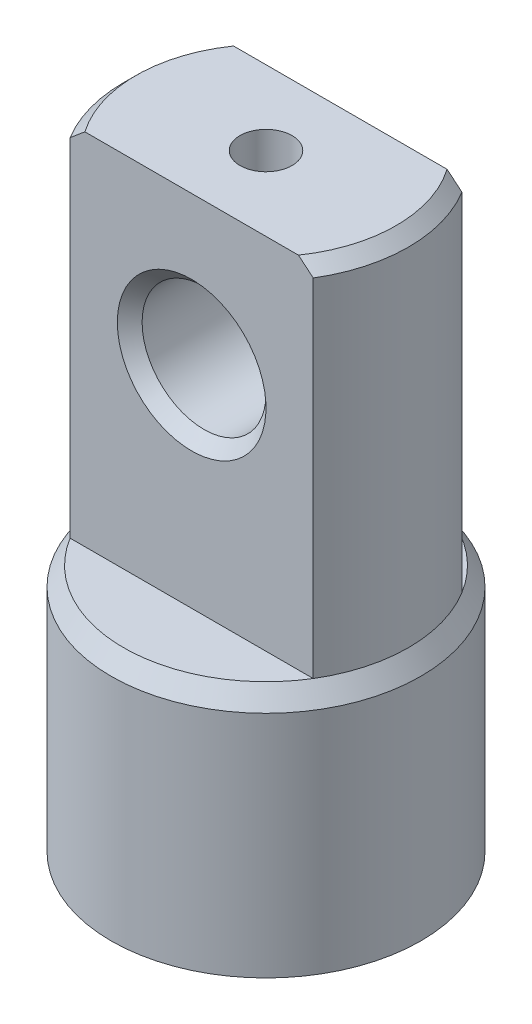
ISO-10303-21;
HEADER;
FILE_DESCRIPTION(('STEP AP214'),'2;1');
FILE_NAME('part.step','',(''),(''),'','','');
FILE_SCHEMA(('AUTOMOTIVE_DESIGN { 1 0 10303 214 1 1 1 1 }'));
ENDSEC;
DATA;
#1=APPLICATION_CONTEXT('core data for automotive mechanical design processes');
#2=APPLICATION_PROTOCOL_DEFINITION('international standard','automotive_design',2000,#1);
#3=PRODUCT_CONTEXT('',#1,'mechanical');
#4=PRODUCT('Part','Part','',(#3));
#5=PRODUCT_RELATED_PRODUCT_CATEGORY('part','',(#4));
#6=PRODUCT_DEFINITION_FORMATION('','',#4);
#7=PRODUCT_DEFINITION_CONTEXT('part definition',#1,'design');
#8=PRODUCT_DEFINITION('design','',#6,#7);
#9=PRODUCT_DEFINITION_SHAPE('','',#8);
#10=(LENGTH_UNIT() NAMED_UNIT(*) SI_UNIT(.MILLI.,.METRE.));
#11=(NAMED_UNIT(*) PLANE_ANGLE_UNIT() SI_UNIT($,.RADIAN.));
#12=(NAMED_UNIT(*) SI_UNIT($,.STERADIAN.) SOLID_ANGLE_UNIT());
#13=UNCERTAINTY_MEASURE_WITH_UNIT(LENGTH_MEASURE(1.E-05),#10,'distance_accuracy_value','');
#14=(GEOMETRIC_REPRESENTATION_CONTEXT(3) GLOBAL_UNCERTAINTY_ASSIGNED_CONTEXT((#13)) GLOBAL_UNIT_ASSIGNED_CONTEXT((#10,
#11,#12)) REPRESENTATION_CONTEXT('',''));
#15=CARTESIAN_POINT('',(0.,0.,0.));
#16=DIRECTION('',(0.,0.,1.));
#17=DIRECTION('',(1.,0.,0.));
#18=AXIS2_PLACEMENT_3D('',#15,#16,#17);
#19=CARTESIAN_POINT('',(0.,0.,0.));
#20=DIRECTION('',(0.,-1.,0.));
#21=DIRECTION('',(0.,0.,-1.));
#22=AXIS2_PLACEMENT_3D('',#19,#20,#21);
#23=CYLINDRICAL_SURFACE('',#22,11.5);
#24=DIRECTION('',(0.,-1.,0.));
#25=VECTOR('',#24,1.);
#26=CARTESIAN_POINT('',(9.81070843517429,0.,-6.));
#27=LINE('',#26,#25);
#28=CARTESIAN_POINT('',(9.81070843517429,48.,-6.));
#29=VERTEX_POINT('',#28);
#30=CARTESIAN_POINT('',(9.81070843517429,20.,-6.));
#31=VERTEX_POINT('',#30);
#32=EDGE_CURVE('E127',#29,#31,#27,.T.);
#33=ORIENTED_EDGE('',*,*,#32,.F.);
#34=CARTESIAN_POINT('',(0.,48.,0.));
#35=DIRECTION('',(0.,1.,0.));
#36=DIRECTION('',(0.,0.,1.));
#37=AXIS2_PLACEMENT_3D('',#34,#35,#36);
#38=CIRCLE('',#37,11.5);
#39=CARTESIAN_POINT('',(9.81070843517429,48.,6.));
#40=VERTEX_POINT('',#39);
#41=EDGE_CURVE('E113',#29,#40,#38,.F.);
#42=ORIENTED_EDGE('',*,*,#41,.T.);
#43=DIRECTION('',(0.,-1.,0.));
#44=VECTOR('',#43,1.);
#45=CARTESIAN_POINT('',(9.81070843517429,0.,6.));
#46=LINE('',#45,#44);
#47=CARTESIAN_POINT('',(9.81070843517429,20.,6.));
#48=VERTEX_POINT('',#47);
#49=EDGE_CURVE('E103',#48,#40,#46,.F.);
#50=ORIENTED_EDGE('',*,*,#49,.F.);
#51=CARTESIAN_POINT('',(0.,20.,0.));
#52=DIRECTION('',(0.,-1.,0.));
#53=DIRECTION('',(0.,0.,-1.));
#54=AXIS2_PLACEMENT_3D('',#51,#52,#53);
#55=CIRCLE('',#54,11.5);
#56=EDGE_CURVE('E95',#31,#48,#55,.T.);
#57=ORIENTED_EDGE('',*,*,#56,.F.);
#58=EDGE_LOOP('',(#33,#42,#50,#57));
#59=FACE_BOUND('',#58,.T.);
#60=ADVANCED_FACE('F32',(#59),#23,.T.);
#61=CARTESIAN_POINT('',(0.,0.,0.));
#62=DIRECTION('',(0.,-1.,0.));
#63=DIRECTION('',(0.,0.,-1.));
#64=AXIS2_PLACEMENT_3D('',#61,#62,#63);
#65=PLANE('',#64);
#66=CARTESIAN_POINT('',(0.,0.,0.));
#67=DIRECTION('',(0.,-1.,0.));
#68=DIRECTION('',(0.,0.,-1.));
#69=AXIS2_PLACEMENT_3D('',#66,#67,#68);
#70=CIRCLE('',#69,12.5);
#71=CARTESIAN_POINT('',(0.,0.,-12.5));
#72=VERTEX_POINT('',#71);
#73=EDGE_CURVE('E122',#72,#72,#70,.T.);
#74=ORIENTED_EDGE('',*,*,#73,.T.);
#75=EDGE_LOOP('',(#74));
#76=FACE_BOUND('',#75,.T.);
#77=ADVANCED_FACE('F157',(#76),#65,.T.);
#78=CARTESIAN_POINT('',(0.,0.,0.));
#79=DIRECTION('',(0.,-1.,0.));
#80=DIRECTION('',(0.,0.,-1.));
#81=AXIS2_PLACEMENT_3D('',#78,#79,#80);
#82=CYLINDRICAL_SURFACE('',#81,12.5);
#83=CARTESIAN_POINT('',(0.,18.5,0.));
#84=DIRECTION('',(0.,-1.,0.));
#85=DIRECTION('',(0.,0.,-1.));
#86=AXIS2_PLACEMENT_3D('',#83,#84,#85);
#87=CIRCLE('',#86,12.5);
#88=CARTESIAN_POINT('',(0.,18.5,-12.5));
#89=VERTEX_POINT('',#88);
#90=EDGE_CURVE('E120',#89,#89,#87,.T.);
#91=ORIENTED_EDGE('',*,*,#90,.T.);
#92=EDGE_LOOP('',(#91));
#93=FACE_BOUND('',#92,.T.);
#94=ORIENTED_EDGE('',*,*,#73,.F.);
#95=EDGE_LOOP('',(#94));
#96=FACE_BOUND('',#95,.T.);
#97=ADVANCED_FACE('F163',(#93,#96),#82,.T.);
#98=CARTESIAN_POINT('',(0.,18.5,0.));
#99=DIRECTION('',(0.,-1.,0.));
#100=DIRECTION('',(0.,0.,-1.));
#101=AXIS2_PLACEMENT_3D('',#98,#99,#100);
#102=CONICAL_SURFACE('',#101,12.5,0.58800260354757);
#103=ORIENTED_EDGE('',*,*,#56,.T.);
#104=CARTESIAN_POINT('',(-9.81070843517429,20.,6.));
#105=VERTEX_POINT('',#104);
#106=EDGE_CURVE('E88',#48,#105,#55,.T.);
#107=ORIENTED_EDGE('',*,*,#106,.T.);
#108=CARTESIAN_POINT('',(-9.81070843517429,20.,-6.));
#109=VERTEX_POINT('',#108);
#110=EDGE_CURVE('E96',#105,#109,#55,.T.);
#111=ORIENTED_EDGE('',*,*,#110,.T.);
#112=EDGE_CURVE('E98',#109,#31,#55,.T.);
#113=ORIENTED_EDGE('',*,*,#112,.T.);
#114=EDGE_LOOP('',(#103,#107,#111,#113));
#115=FACE_BOUND('',#114,.T.);
#116=ORIENTED_EDGE('',*,*,#90,.F.);
#117=EDGE_LOOP('',(#116));
#118=FACE_BOUND('',#117,.T.);
#119=ADVANCED_FACE('F117',(#115,#118),#102,.T.);
#120=DIRECTION('',(0.,-1.,0.));
#121=VECTOR('',#120,1.);
#122=CARTESIAN_POINT('',(-9.81070843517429,0.,6.));
#123=LINE('',#122,#121);
#124=CARTESIAN_POINT('',(-9.81070843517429,48.,6.));
#125=VERTEX_POINT('',#124);
#126=EDGE_CURVE('E105',#125,#105,#123,.T.);
#127=ORIENTED_EDGE('',*,*,#126,.F.);
#128=CARTESIAN_POINT('',(0.,48.,0.));
#129=DIRECTION('',(0.,1.,0.));
#130=DIRECTION('',(0.,0.,1.));
#131=AXIS2_PLACEMENT_3D('',#128,#129,#130);
#132=CIRCLE('',#131,11.5);
#133=CARTESIAN_POINT('',(-9.81070843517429,48.,-6.));
#134=VERTEX_POINT('',#133);
#135=EDGE_CURVE('E177',#125,#134,#132,.F.);
#136=ORIENTED_EDGE('',*,*,#135,.T.);
#137=DIRECTION('',(0.,-1.,0.));
#138=VECTOR('',#137,1.);
#139=CARTESIAN_POINT('',(-9.81070843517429,0.,-6.));
#140=LINE('',#139,#138);
#141=EDGE_CURVE('E125',#109,#134,#140,.F.);
#142=ORIENTED_EDGE('',*,*,#141,.F.);
#143=ORIENTED_EDGE('',*,*,#110,.F.);
#144=EDGE_LOOP('',(#127,#136,#142,#143));
#145=FACE_BOUND('',#144,.T.);
#146=ADVANCED_FACE('F159',(#145),#23,.T.);
#147=CARTESIAN_POINT('',(11.5,49.,0.));
#148=DIRECTION('',(0.,1.,0.));
#149=DIRECTION('',(0.,0.,1.));
#150=AXIS2_PLACEMENT_3D('',#147,#148,#149);
#151=PLANE('',#150);
#152=CARTESIAN_POINT('',(0.,49.,0.));
#153=DIRECTION('',(0.,1.,0.));
#154=DIRECTION('',(0.,0.,1.));
#155=AXIS2_PLACEMENT_3D('',#152,#153,#154);
#156=CIRCLE('',#155,2.1);
#157=CARTESIAN_POINT('',(0.,49.,2.1));
#158=VERTEX_POINT('',#157);
#159=EDGE_CURVE('E142',#158,#158,#156,.T.);
#160=ORIENTED_EDGE('',*,*,#159,.F.);
#161=EDGE_LOOP('',(#160));
#162=FACE_BOUND('',#161,.T.);
#163=DIRECTION('',(-1.,0.,0.));
#164=VECTOR('',#163,1.);
#165=CARTESIAN_POINT('',(11.5,49.,6.));
#166=LINE('',#165,#164);
#167=CARTESIAN_POINT('',(8.61684396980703,49.,6.));
#168=VERTEX_POINT('',#167);
#169=CARTESIAN_POINT('',(-8.61684396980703,49.,6.));
#170=VERTEX_POINT('',#169);
#171=EDGE_CURVE('E210',#168,#170,#166,.T.);
#172=ORIENTED_EDGE('',*,*,#171,.F.);
#173=CARTESIAN_POINT('',(0.,49.,0.));
#174=DIRECTION('',(0.,1.,0.));
#175=DIRECTION('',(0.,0.,1.));
#176=AXIS2_PLACEMENT_3D('',#173,#174,#175);
#177=CIRCLE('',#176,10.5);
#178=CARTESIAN_POINT('',(8.61684396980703,49.,-6.));
#179=VERTEX_POINT('',#178);
#180=EDGE_CURVE('E55',#168,#179,#177,.T.);
#181=ORIENTED_EDGE('',*,*,#180,.T.);
#182=DIRECTION('',(1.,0.,0.));
#183=VECTOR('',#182,1.);
#184=CARTESIAN_POINT('',(11.5,49.,-6.));
#185=LINE('',#184,#183);
#186=CARTESIAN_POINT('',(-8.61684396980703,49.,-6.));
#187=VERTEX_POINT('',#186);
#188=EDGE_CURVE('E208',#187,#179,#185,.T.);
#189=ORIENTED_EDGE('',*,*,#188,.F.);
#190=CARTESIAN_POINT('',(0.,49.,0.));
#191=DIRECTION('',(0.,1.,0.));
#192=DIRECTION('',(0.,0.,1.));
#193=AXIS2_PLACEMENT_3D('',#190,#191,#192);
#194=CIRCLE('',#193,10.5);
#195=EDGE_CURVE('E244',#187,#170,#194,.T.);
#196=ORIENTED_EDGE('',*,*,#195,.T.);
#197=EDGE_LOOP('',(#172,#181,#189,#196));
#198=FACE_BOUND('',#197,.T.);
#199=ADVANCED_FACE('F169',(#162,#198),#151,.T.);
#200=CARTESIAN_POINT('',(-10.9658560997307,20.,-6.));
#201=DIRECTION('',(0.,0.,1.));
#202=DIRECTION('',(1.,0.,0.));
#203=AXIS2_PLACEMENT_3D('',#200,#201,#202);
#204=PLANE('',#203);
#205=CARTESIAN_POINT('',(0.,37.,-6.));
#206=DIRECTION('',(0.,0.,1.));
#207=DIRECTION('',(1.,0.,0.));
#208=AXIS2_PLACEMENT_3D('',#205,#206,#207);
#209=CIRCLE('',#208,5.99999999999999);
#210=CARTESIAN_POINT('',(5.99999999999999,37.,-6.));
#211=VERTEX_POINT('',#210);
#212=EDGE_CURVE('E181',#211,#211,#209,.T.);
#213=ORIENTED_EDGE('',*,*,#212,.T.);
#214=EDGE_LOOP('',(#213));
#215=FACE_BOUND('',#214,.T.);
#216=ORIENTED_EDGE('',*,*,#188,.T.);
#217=CARTESIAN_POINT('',(8.61684396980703,49.,-6.));
#218=CARTESIAN_POINT('',(8.71716770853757,48.9176678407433,-6.));
#219=CARTESIAN_POINT('',(8.81726226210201,48.8350568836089,-6.));
#220=CARTESIAN_POINT('',(9.01702237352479,48.6693224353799,-6.));
#221=CARTESIAN_POINT('',(9.11668794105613,48.5861989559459,-6.));
#222=CARTESIAN_POINT('',(9.31562370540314,48.4194810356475,-6.));
#223=CARTESIAN_POINT('',(9.41489390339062,48.3358865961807,-6.));
#224=CARTESIAN_POINT('',(9.61306891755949,48.1682611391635,-6.));
#225=CARTESIAN_POINT('',(9.7119737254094,48.0842301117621,-6.));
#226=CARTESIAN_POINT('',(9.81070843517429,48.,-6.));
#227=B_SPLINE_CURVE_WITH_KNOTS('',3,(#217,#218,#219,#220,#221,#222,#223,#224,#225,#226),
.UNSPECIFIED.,.F.,.F.,(4,2,2,2,4),(0.,0.389345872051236,0.778682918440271,1.16801881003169,
1.55736352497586),.UNSPECIFIED.);
#228=EDGE_CURVE('E182',#179,#29,#227,.T.);
#229=ORIENTED_EDGE('',*,*,#228,.T.);
#230=ORIENTED_EDGE('',*,*,#32,.T.);
#231=DIRECTION('',(1.,0.,0.));
#232=VECTOR('',#231,1.);
#233=CARTESIAN_POINT('',(-10.9658560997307,20.,-6.));
#234=LINE('',#233,#232);
#235=EDGE_CURVE('E114',#109,#31,#234,.T.);
#236=ORIENTED_EDGE('',*,*,#235,.F.);
#237=ORIENTED_EDGE('',*,*,#141,.T.);
#238=CARTESIAN_POINT('',(-9.81070843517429,48.,-6.));
#239=CARTESIAN_POINT('',(-9.7119737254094,48.0842301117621,-6.));
#240=CARTESIAN_POINT('',(-9.61306891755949,48.1682611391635,-6.));
#241=CARTESIAN_POINT('',(-9.41489390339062,48.3358865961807,-6.));
#242=CARTESIAN_POINT('',(-9.31562370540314,48.4194810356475,-6.));
#243=CARTESIAN_POINT('',(-9.11668794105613,48.5861989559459,-6.));
#244=CARTESIAN_POINT('',(-9.01702237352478,48.6693224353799,-6.));
#245=CARTESIAN_POINT('',(-8.81726226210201,48.8350568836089,-6.));
#246=CARTESIAN_POINT('',(-8.71716770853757,48.9176678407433,-6.));
#247=CARTESIAN_POINT('',(-8.61684396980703,49.,-6.));
#248=B_SPLINE_CURVE_WITH_KNOTS('',3,(#238,#239,#240,#241,#242,#243,#244,#245,#246,#247),
.UNSPECIFIED.,.F.,.F.,(4,2,2,2,4),(0.,0.389344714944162,0.778680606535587,1.16801765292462,
1.55736352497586),.UNSPECIFIED.);
#249=EDGE_CURVE('E47',#134,#187,#248,.T.);
#250=ORIENTED_EDGE('',*,*,#249,.T.);
#251=EDGE_LOOP('',(#216,#229,#230,#236,#237,#250));
#252=FACE_BOUND('',#251,.T.);
#253=ADVANCED_FACE('F175',(#215,#252),#204,.F.);
#254=CARTESIAN_POINT('',(0.,20.,0.));
#255=DIRECTION('',(0.,1.,0.));
#256=DIRECTION('',(0.,0.,1.));
#257=AXIS2_PLACEMENT_3D('',#254,#255,#256);
#258=PLANE('',#257);
#259=ORIENTED_EDGE('',*,*,#235,.T.);
#260=ORIENTED_EDGE('',*,*,#112,.F.);
#261=EDGE_LOOP('',(#259,#260));
#262=FACE_BOUND('',#261,.T.);
#263=ADVANCED_FACE('F207',(#262),#258,.T.);
#264=CARTESIAN_POINT('',(-10.9658560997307,20.,6.));
#265=DIRECTION('',(0.,0.,-1.));
#266=DIRECTION('',(-1.,0.,0.));
#267=AXIS2_PLACEMENT_3D('',#264,#265,#266);
#268=PLANE('',#267);
#269=CARTESIAN_POINT('',(0.,37.,6.));
#270=DIRECTION('',(0.,0.,-1.));
#271=DIRECTION('',(-1.,0.,0.));
#272=AXIS2_PLACEMENT_3D('',#269,#270,#271);
#273=CIRCLE('',#272,6.00000000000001);
#274=CARTESIAN_POINT('',(-6.00000000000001,37.,6.));
#275=VERTEX_POINT('',#274);
#276=EDGE_CURVE('E11',#275,#275,#273,.T.);
#277=ORIENTED_EDGE('',*,*,#276,.T.);
#278=EDGE_LOOP('',(#277));
#279=FACE_BOUND('',#278,.T.);
#280=ORIENTED_EDGE('',*,*,#49,.T.);
#281=CARTESIAN_POINT('',(9.81070843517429,48.,6.));
#282=CARTESIAN_POINT('',(9.7119737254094,48.0842301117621,6.));
#283=CARTESIAN_POINT('',(9.61306891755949,48.1682611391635,6.));
#284=CARTESIAN_POINT('',(9.41489390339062,48.3358865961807,6.));
#285=CARTESIAN_POINT('',(9.31562370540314,48.4194810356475,6.));
#286=CARTESIAN_POINT('',(9.11668794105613,48.5861989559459,6.));
#287=CARTESIAN_POINT('',(9.01702237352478,48.6693224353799,6.));
#288=CARTESIAN_POINT('',(8.81726226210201,48.8350568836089,6.));
#289=CARTESIAN_POINT('',(8.71716770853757,48.9176678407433,6.));
#290=CARTESIAN_POINT('',(8.61684396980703,49.,6.));
#291=B_SPLINE_CURVE_WITH_KNOTS('',3,(#281,#282,#283,#284,#285,#286,#287,#288,#289,#290),
.UNSPECIFIED.,.F.,.F.,(4,2,2,2,4),(0.,0.389344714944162,0.778680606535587,1.16801765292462,
1.55736352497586),.UNSPECIFIED.);
#292=EDGE_CURVE('E214',#40,#168,#291,.T.);
#293=ORIENTED_EDGE('',*,*,#292,.T.);
#294=ORIENTED_EDGE('',*,*,#171,.T.);
#295=CARTESIAN_POINT('',(-8.61684396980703,49.,6.));
#296=CARTESIAN_POINT('',(-8.71716770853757,48.9176678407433,6.));
#297=CARTESIAN_POINT('',(-8.81726226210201,48.8350568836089,6.));
#298=CARTESIAN_POINT('',(-9.01702237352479,48.6693224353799,6.));
#299=CARTESIAN_POINT('',(-9.11668794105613,48.5861989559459,6.));
#300=CARTESIAN_POINT('',(-9.31562370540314,48.4194810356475,6.));
#301=CARTESIAN_POINT('',(-9.41489390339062,48.3358865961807,6.));
#302=CARTESIAN_POINT('',(-9.61306891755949,48.1682611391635,6.));
#303=CARTESIAN_POINT('',(-9.7119737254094,48.0842301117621,6.));
#304=CARTESIAN_POINT('',(-9.81070843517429,48.,6.));
#305=B_SPLINE_CURVE_WITH_KNOTS('',3,(#295,#296,#297,#298,#299,#300,#301,#302,#303,#304),
.UNSPECIFIED.,.F.,.F.,(4,2,2,2,4),(0.,0.389345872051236,0.778682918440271,1.16801881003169,
1.55736352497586),.UNSPECIFIED.);
#306=EDGE_CURVE('E180',#170,#125,#305,.T.);
#307=ORIENTED_EDGE('',*,*,#306,.T.);
#308=ORIENTED_EDGE('',*,*,#126,.T.);
#309=DIRECTION('',(-1.,0.,0.));
#310=VECTOR('',#309,1.);
#311=CARTESIAN_POINT('',(-10.9658560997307,20.,6.));
#312=LINE('',#311,#310);
#313=EDGE_CURVE('E91',#48,#105,#312,.T.);
#314=ORIENTED_EDGE('',*,*,#313,.F.);
#315=EDGE_LOOP('',(#280,#293,#294,#307,#308,#314));
#316=FACE_BOUND('',#315,.T.);
#317=ADVANCED_FACE('F102',(#279,#316),#268,.F.);
#318=CARTESIAN_POINT('',(0.,20.,0.));
#319=DIRECTION('',(0.,1.,0.));
#320=DIRECTION('',(0.,0.,1.));
#321=AXIS2_PLACEMENT_3D('',#318,#319,#320);
#322=PLANE('',#321);
#323=ORIENTED_EDGE('',*,*,#313,.T.);
#324=ORIENTED_EDGE('',*,*,#106,.F.);
#325=EDGE_LOOP('',(#323,#324));
#326=FACE_BOUND('',#325,.T.);
#327=ADVANCED_FACE('F90',(#326),#322,.T.);
#328=CARTESIAN_POINT('',(0.,48.,0.));
#329=DIRECTION('',(0.,-1.,0.));
#330=DIRECTION('',(0.,0.,-1.));
#331=AXIS2_PLACEMENT_3D('',#328,#329,#330);
#332=CONICAL_SURFACE('',#331,11.5,0.78539816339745);
#333=ORIENTED_EDGE('',*,*,#228,.F.);
#334=ORIENTED_EDGE('',*,*,#180,.F.);
#335=ORIENTED_EDGE('',*,*,#292,.F.);
#336=ORIENTED_EDGE('',*,*,#41,.F.);
#337=EDGE_LOOP('',(#333,#334,#335,#336));
#338=FACE_BOUND('',#337,.T.);
#339=ADVANCED_FACE('F213',(#338),#332,.T.);
#340=CARTESIAN_POINT('',(0.,48.,0.));
#341=DIRECTION('',(0.,-1.,0.));
#342=DIRECTION('',(0.,0.,-1.));
#343=AXIS2_PLACEMENT_3D('',#340,#341,#342);
#344=CONICAL_SURFACE('',#343,11.5,0.78539816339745);
#345=ORIENTED_EDGE('',*,*,#306,.F.);
#346=ORIENTED_EDGE('',*,*,#195,.F.);
#347=ORIENTED_EDGE('',*,*,#249,.F.);
#348=ORIENTED_EDGE('',*,*,#135,.F.);
#349=EDGE_LOOP('',(#345,#346,#347,#348));
#350=FACE_BOUND('',#349,.T.);
#351=ADVANCED_FACE('F179',(#350),#344,.T.);
#352=CARTESIAN_POINT('',(0.,37.,6.));
#353=DIRECTION('',(0.,0.,1.));
#354=DIRECTION('',(1.,0.,0.));
#355=AXIS2_PLACEMENT_3D('',#352,#353,#354);
#356=CYLINDRICAL_SURFACE('',#355,5.);
#357=CARTESIAN_POINT('',(0.,42.,2.1));
#358=CARTESIAN_POINT('',(0.112421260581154,41.9999933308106,2.0999912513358));
#359=CARTESIAN_POINT('',(0.225000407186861,41.9961659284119,2.09092141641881));
#360=CARTESIAN_POINT('',(0.446972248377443,41.981231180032,2.05497450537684));
#361=CARTESIAN_POINT('',(0.55635593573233,41.9701050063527,2.02805137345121));
#362=CARTESIAN_POINT('',(0.76835039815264,41.9417643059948,1.95756693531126));
#363=CARTESIAN_POINT('',(0.87098288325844,41.9245705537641,1.91406236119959));
#364=CARTESIAN_POINT('',(1.06739278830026,41.8857658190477,1.81188714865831));
#365=CARTESIAN_POINT('',(1.16117280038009,41.8641561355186,1.75322096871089));
#366=CARTESIAN_POINT('',(1.3421338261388,41.817448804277,1.61923837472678));
#367=CARTESIAN_POINT('',(1.42880573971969,41.7922357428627,1.54327496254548));
#368=CARTESIAN_POINT('',(1.58861874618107,41.741659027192,1.37822285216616));
#369=CARTESIAN_POINT('',(1.66175260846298,41.7162952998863,1.2891271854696));
#370=CARTESIAN_POINT('',(1.79604183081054,41.6668635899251,1.09492195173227));
#371=CARTESIAN_POINT('',(1.85641196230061,41.6429244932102,0.989233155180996));
#372=CARTESIAN_POINT('',(1.9582903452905,41.6008867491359,0.768050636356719));
#373=CARTESIAN_POINT('',(1.99980846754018,41.5827850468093,0.652562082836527));
#374=CARTESIAN_POINT('',(2.06069339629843,41.5557228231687,0.420918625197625));
#375=CARTESIAN_POINT('',(2.08104088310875,41.5463599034,0.305070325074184));
#376=CARTESIAN_POINT('',(2.10206556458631,41.5366803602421,0.0712546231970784));
#377=CARTESIAN_POINT('',(2.10275385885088,41.5363586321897,-0.0467115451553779));
#378=CARTESIAN_POINT('',(2.08517838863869,41.5444578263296,-0.271572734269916));
#379=CARTESIAN_POINT('',(2.06839112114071,41.5521976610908,-0.378612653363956));
#380=CARTESIAN_POINT('',(2.01882069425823,41.5743953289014,-0.588185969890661));
#381=CARTESIAN_POINT('',(1.98603441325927,41.5888544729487,-0.690718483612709));
#382=CARTESIAN_POINT('',(1.9047552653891,41.6231896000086,-0.890977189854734));
#383=CARTESIAN_POINT('',(1.8559407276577,41.6431750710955,-0.988553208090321));
#384=CARTESIAN_POINT('',(1.74421855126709,41.6862864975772,-1.17451248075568));
#385=CARTESIAN_POINT('',(1.68130530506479,41.7094137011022,-1.26289205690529));
#386=CARTESIAN_POINT('',(1.53682141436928,41.7586218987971,-1.43594957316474));
#387=CARTESIAN_POINT('',(1.4541115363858,41.784785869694,-1.51965550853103));
#388=CARTESIAN_POINT('',(1.27557303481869,41.8354439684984,-1.67233793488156));
#389=CARTESIAN_POINT('',(1.17974124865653,41.8599376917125,-1.74131086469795));
#390=CARTESIAN_POINT('',(0.974684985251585,41.9052275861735,-1.86402615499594));
#391=CARTESIAN_POINT('',(0.865196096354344,41.9259219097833,-1.9173670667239));
#392=CARTESIAN_POINT('',(0.637707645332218,41.9604970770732,-2.00453047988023));
#393=CARTESIAN_POINT('',(0.519712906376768,41.974381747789,-2.03836394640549));
#394=CARTESIAN_POINT('',(0.286679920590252,41.993054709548,-2.08350356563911));
#395=CARTESIAN_POINT('',(0.171936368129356,41.9983686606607,-2.09611378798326));
#396=CARTESIAN_POINT('',(-0.0581412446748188,42.0009838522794,-2.10234434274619));
#397=CARTESIAN_POINT('',(-0.173475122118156,41.998287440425,-2.0959702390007));
#398=CARTESIAN_POINT('',(-0.395312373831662,41.9855250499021,-2.06534125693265));
#399=CARTESIAN_POINT('',(-0.501967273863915,41.9758388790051,-2.04200747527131));
#400=CARTESIAN_POINT('',(-0.709728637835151,41.9504793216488,-1.97940931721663));
#401=CARTESIAN_POINT('',(-0.810834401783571,41.934805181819,-1.94014293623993));
#402=CARTESIAN_POINT('',(-1.00818189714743,41.8983626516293,-1.84551304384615));
#403=CARTESIAN_POINT('',(-1.10417428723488,41.877450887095,-1.78968654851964));
#404=CARTESIAN_POINT('',(-1.2857730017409,41.8327577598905,-1.66402912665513));
#405=CARTESIAN_POINT('',(-1.37137493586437,41.808975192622,-1.59419231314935));
#406=CARTESIAN_POINT('',(-1.53629380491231,41.758966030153,-1.43657093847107));
#407=CARTESIAN_POINT('',(-1.61470399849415,41.7326873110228,-1.34785177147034));
#408=CARTESIAN_POINT('',(-1.75578239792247,41.682185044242,-1.15810542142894));
#409=CARTESIAN_POINT('',(-1.81844681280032,41.6579619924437,-1.05707528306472));
#410=CARTESIAN_POINT('',(-1.92699302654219,41.6141295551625,-0.843367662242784));
#411=CARTESIAN_POINT('',(-1.97260446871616,41.5945961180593,-0.730536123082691));
#412=CARTESIAN_POINT('',(-2.04378702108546,41.563383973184,-0.497714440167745));
#413=CARTESIAN_POINT('',(-2.06937501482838,41.5516986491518,-0.37773041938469));
#414=CARTESIAN_POINT('',(-2.09809375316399,41.5385272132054,-0.144087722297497));
#415=CARTESIAN_POINT('',(-2.10281966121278,41.5363170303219,-0.0306650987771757));
#416=CARTESIAN_POINT('',(-2.09395263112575,41.5404170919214,0.195292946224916));
#417=CARTESIAN_POINT('',(-2.0803626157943,41.5467259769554,0.307828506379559));
#418=CARTESIAN_POINT('',(-2.03659654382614,41.5664869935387,0.523240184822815));
#419=CARTESIAN_POINT('',(-2.00724892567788,41.5795812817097,0.626320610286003));
#420=CARTESIAN_POINT('',(-1.93361811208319,41.6111513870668,0.826114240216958));
#421=CARTESIAN_POINT('',(-1.88933070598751,41.6296287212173,0.922825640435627));
#422=CARTESIAN_POINT('',(-1.78398506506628,41.6712723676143,1.11354185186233));
#423=CARTESIAN_POINT('',(-1.72207244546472,41.6946551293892,1.2070265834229));
#424=CARTESIAN_POINT('',(-1.5844223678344,41.7428812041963,1.38277882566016));
#425=CARTESIAN_POINT('',(-1.50867999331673,41.7677250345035,1.46504232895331));
#426=CARTESIAN_POINT('',(-1.33881414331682,41.8182968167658,1.62232622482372));
#427=CARTESIAN_POINT('',(-1.24374163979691,41.8439527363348,1.69635035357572));
#428=CARTESIAN_POINT('',(-1.04160910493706,41.8914040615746,1.82745043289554));
#429=CARTESIAN_POINT('',(-0.934543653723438,41.9131977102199,1.88451867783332));
#430=CARTESIAN_POINT('',(-0.712909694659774,41.9501639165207,1.97888688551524));
#431=CARTESIAN_POINT('',(-0.598488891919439,41.965436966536,2.01648893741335));
#432=CARTESIAN_POINT('',(-0.423046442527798,41.9824202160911,2.0578272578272));
#433=CARTESIAN_POINT('',(-0.363983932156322,41.9870920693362,2.06909260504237));
#434=CARTESIAN_POINT('',(-0.244993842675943,41.9943480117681,2.08652360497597));
#435=CARTESIAN_POINT('',(-0.185066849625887,41.9969334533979,2.09269256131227));
#436=CARTESIAN_POINT('',(-0.0833788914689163,41.9994792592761,2.0987597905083));
#437=CARTESIAN_POINT('',(-0.0417003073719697,42.0000024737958,2.10000324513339));
#438=CARTESIAN_POINT('',(0.,42.,2.1));
#439=B_SPLINE_CURVE_WITH_KNOTS('',3,(#357,#358,#359,#360,#361,#362,#363,#364,#365,#366,#367,
#368,#369,#370,#371,#372,#373,#374,#375,#376,#377,#378,#379,#380,#381,#382,#383,#384,#385,#386,
#387,#388,#389,#390,#391,#392,#393,#394,#395,#396,#397,#398,#399,#400,#401,#402,#403,#404,#405,
#406,#407,#408,#409,#410,#411,#412,#413,#414,#415,#416,#417,#418,#419,#420,#421,#422,#423,#424,
#425,#426,#427,#428,#429,#430,#431,#432,#433,#434,#435,#436,#437,#438),.UNSPECIFIED.,.T.,.F.,(4,
2,2,2,2,2,2,2,2,2,2,2,2,2,2,2,2,2,2,2,2,2,2,2,2,2,2,2,2,2,2,2,2,2,2,2,2,2,2,2,4),(0.,
0.337117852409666,0.675108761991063,1.01195349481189,1.34869928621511,1.70109212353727,
2.05367263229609,2.42394551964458,2.79402431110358,3.14607251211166,3.49792194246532,
3.82228185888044,4.14670508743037,4.47808378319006,4.809594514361,5.16961532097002,
5.52972305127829,5.89839924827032,6.26686801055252,6.61173647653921,6.95650388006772,
7.28382587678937,7.61118906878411,7.94874145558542,8.28643597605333,8.64863382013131,
9.01091878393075,9.37872565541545,9.74622206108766,10.0850701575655,10.4238641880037,
10.7463772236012,11.0689812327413,11.4111551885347,11.7534510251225,12.1212491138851,
12.4892140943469,12.851283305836,13.0320009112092,13.2126012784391,13.3376480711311),.UNSPECIFIED.);
#440=CARTESIAN_POINT('',(0.,42.,2.1));
#441=VERTEX_POINT('',#440);
#442=EDGE_CURVE('E106',#441,#441,#439,.T.);
#443=ORIENTED_EDGE('',*,*,#442,.T.);
#444=EDGE_LOOP('',(#443));
#445=FACE_BOUND('',#444,.T.);
#446=CARTESIAN_POINT('',(0.,37.,-5.));
#447=DIRECTION('',(0.,0.,1.));
#448=DIRECTION('',(1.,0.,0.));
#449=AXIS2_PLACEMENT_3D('',#446,#447,#448);
#450=CIRCLE('',#449,5.);
#451=CARTESIAN_POINT('',(5.,37.,-5.));
#452=VERTEX_POINT('',#451);
#453=EDGE_CURVE('E40',#452,#452,#450,.F.);
#454=ORIENTED_EDGE('',*,*,#453,.T.);
#455=EDGE_LOOP('',(#454));
#456=FACE_BOUND('',#455,.T.);
#457=CARTESIAN_POINT('',(0.,37.,4.99999999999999));
#458=DIRECTION('',(0.,0.,-1.));
#459=DIRECTION('',(-1.,0.,0.));
#460=AXIS2_PLACEMENT_3D('',#457,#458,#459);
#461=CIRCLE('',#460,5.);
#462=CARTESIAN_POINT('',(-5.,37.,4.99999999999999));
#463=VERTEX_POINT('',#462);
#464=EDGE_CURVE('E185',#463,#463,#461,.F.);
#465=ORIENTED_EDGE('',*,*,#464,.T.);
#466=EDGE_LOOP('',(#465));
#467=FACE_BOUND('',#466,.T.);
#468=ADVANCED_FACE('F199',(#445,#456,#467),#356,.F.);
#469=CARTESIAN_POINT('',(0.,37.,-6.));
#470=DIRECTION('',(0.,0.,-1.));
#471=DIRECTION('',(-1.,0.,0.));
#472=AXIS2_PLACEMENT_3D('',#469,#470,#471);
#473=CONICAL_SURFACE('',#472,5.99999999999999,0.785398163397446);
#474=ORIENTED_EDGE('',*,*,#453,.F.);
#475=EDGE_LOOP('',(#474));
#476=FACE_BOUND('',#475,.T.);
#477=ORIENTED_EDGE('',*,*,#212,.F.);
#478=EDGE_LOOP('',(#477));
#479=FACE_BOUND('',#478,.T.);
#480=ADVANCED_FACE('F152',(#476,#479),#473,.F.);
#481=CARTESIAN_POINT('',(0.,37.,4.99999999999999));
#482=DIRECTION('',(0.,0.,1.));
#483=DIRECTION('',(1.,0.,0.));
#484=AXIS2_PLACEMENT_3D('',#481,#482,#483);
#485=CONICAL_SURFACE('',#484,5.,0.785398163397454);
#486=ORIENTED_EDGE('',*,*,#276,.F.);
#487=EDGE_LOOP('',(#486));
#488=FACE_BOUND('',#487,.T.);
#489=ORIENTED_EDGE('',*,*,#464,.F.);
#490=EDGE_LOOP('',(#489));
#491=FACE_BOUND('',#490,.T.);
#492=ADVANCED_FACE('F34',(#488,#491),#485,.F.);
#493=CARTESIAN_POINT('',(0.,49.,0.));
#494=DIRECTION('',(0.,1.,0.));
#495=DIRECTION('',(0.,0.,1.));
#496=AXIS2_PLACEMENT_3D('',#493,#494,#495);
#497=CYLINDRICAL_SURFACE('',#496,2.1);
#498=ORIENTED_EDGE('',*,*,#442,.F.);
#499=EDGE_LOOP('',(#498));
#500=FACE_BOUND('',#499,.T.);
#501=ORIENTED_EDGE('',*,*,#159,.T.);
#502=EDGE_LOOP('',(#501));
#503=FACE_BOUND('',#502,.T.);
#504=ADVANCED_FACE('F145',(#500,#503),#497,.F.);
#505=CLOSED_SHELL('',(#60,#77,#97,#119,#146,#199,#253,#263,#317,#327,#339,#351,#468,#480,#492,#504));
#506=MANIFOLD_SOLID_BREP('B2',#505);
#507=ADVANCED_BREP_SHAPE_REPRESENTATION('',(#18,#506),#14);
#508=SHAPE_DEFINITION_REPRESENTATION(#9,#507);
ENDSEC;
END-ISO-10303-21;
